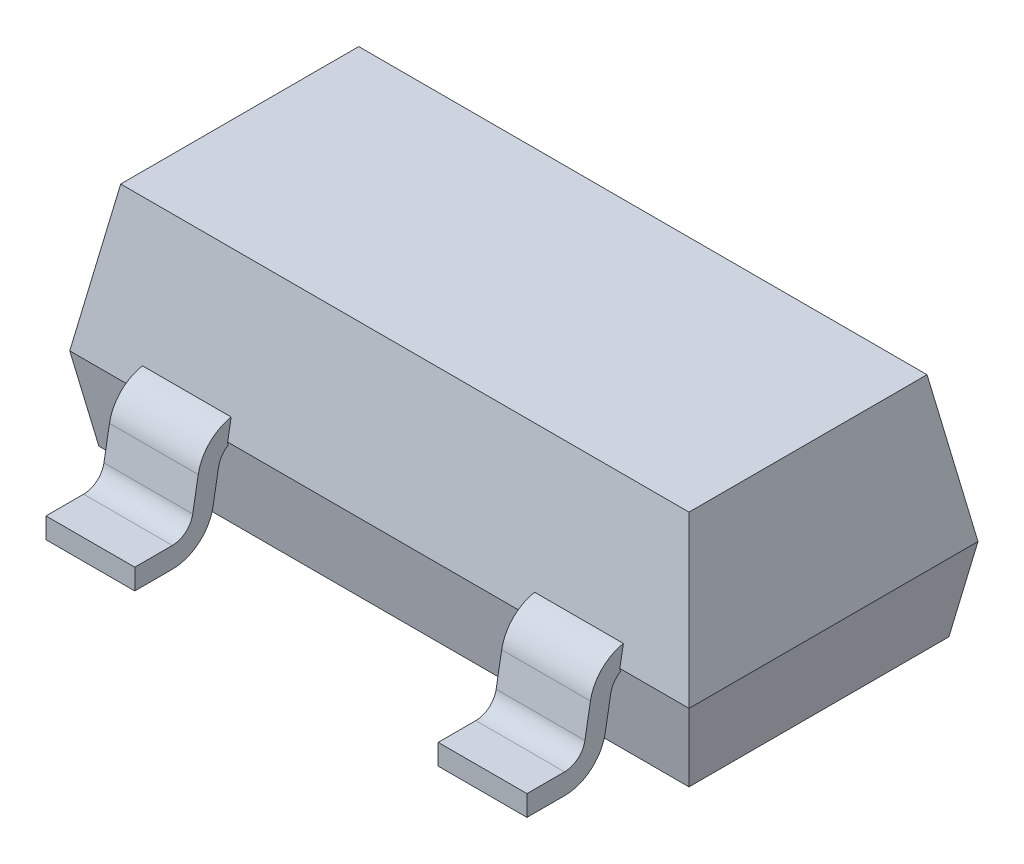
from build123d import *

# Parameters (mm, degrees)
EXTRUDE_START             = -1.165
EXTRUDE_1_DEPTH           = 2.33
SKETCH_2_W                = 0.95
SKETCH_2_H                = 1
SKETCH_2_W_2              = 1.47
CUT_EXTRUDE_1_DEPTH       = 2.711643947
SKETCH_3_W                = 3
SKETCH_3_H                = 1.4
EXTRUDE_2_DEPTH           = 0.7
EXTRUDE_2_DRAFT           = -10
EXTRUDE_2_OTHER_WAY_DEPTH = 0.4
EXTRUDE_2_OTHER_WAY_TAPER = 10


with BuildPart() as part:
    # Sketch 1 → Extrude 1 (new body)
    with BuildSketch(Plane(origin=(0, 0, 0), x_dir=(0, 0, -1), z_dir=(1, 0, 0)).offset(EXTRUDE_START)):
        with BuildLine():
            Line((-1.15, 0), (-0.967819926, 0))
            ThreePointArc((-0.967819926, 0), (-0.839262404, 0.046791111), (-0.770858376, 0.165270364))
            Line((-0.770858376, 0.165270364), (-0.74404002, 0.317364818))
            ThreePointArc((-0.74404002, 0.317364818), (-0.709838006, 0.376604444), (-0.645559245, 0.4))
            Line((-0.645559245, 0.4), (0.645559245, 0.4))
            ThreePointArc((0.645559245, 0.4), (0.709838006, 0.376604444), (0.74404002, 0.317364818))
            Line((0.74404002, 0.317364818), (0.770858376, 0.165270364))
            ThreePointArc((0.770858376, 0.165270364), (0.839262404, 0.046791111), (0.967819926, 0))
            Line((0.967819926, 0), (1.15, 0))
            Line((1.15, 0), (1.15, 0.1))
            Line((1.15, 0.1), (0.967819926, 0.1))
            ThreePointArc((0.967819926, 0.1), (0.903541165, 0.123395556), (0.869339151, 0.182635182))
            Line((0.869339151, 0.182635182), (0.842520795, 0.334729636))
            ThreePointArc((0.842520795, 0.334729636), (0.774116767, 0.453208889), (0.645559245, 0.5))
            Line((0.645559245, 0.5), (-0.645559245, 0.5))
            ThreePointArc((-0.645559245, 0.5), (-0.774116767, 0.453208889), (-0.842520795, 0.334729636))
            Line((-0.842520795, 0.334729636), (-0.869339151, 0.182635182))
            ThreePointArc((-0.869339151, 0.182635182), (-0.903541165, 0.123395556), (-0.967819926, 0.1))
            Line((-0.967819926, 0.1), (-1.15, 0.1))
            Line((-1.15, 0.1), (-1.15, 0))
        make_face()
    extrude(amount=EXTRUDE_1_DEPTH)

    # Sketch 2 → Cut-Extrude 1 (cut, through all)
    with BuildSketch(Plane(origin=(0, 0, 0), x_dir=(1, 0, 0), z_dir=(0, 1, 0))):
        with Locations((-0.69, 0.65)):
            Rectangle(SKETCH_2_W, SKETCH_2_H)
        with Locations((0, -0.65)):
            Rectangle(SKETCH_2_W_2, SKETCH_2_H)
        with Locations((0.69, 0.65)):
            Rectangle(SKETCH_2_W, SKETCH_2_H)
    extrude(amount=CUT_EXTRUDE_1_DEPTH, mode=Mode.SUBTRACT)


with BuildPart() as extrude_2_tool:
    # Sketch 3 → Extrude 2 (with draft: the straight prism first)
    with BuildSketch(Plane.XZ.offset(-0.4)):
        Rectangle(SKETCH_3_W, SKETCH_3_H)
    extrude(amount=-EXTRUDE_2_DEPTH)
    # Extrude 2: the draft: its side faces are tilted about the plane it starts from
    extrude_2_sides = [extrude_2_tool.faces().sort_by_distance(p)[0] for p in [
        (0, 0.75, -0.7),
        (1.5, 0.75, 0),
        (0, 0.75, 0.7),
        (-1.5, 0.75, 0),
    ]]
    draft(extrude_2_sides, Plane.XZ.offset(-0.4), EXTRUDE_2_DRAFT)


with BuildPart() as part_1:
    add(part.part)

    # Extrude 2: add extrude_2_tool
    add(extrude_2_tool.part)

    # Sketch 3 → Extrude 2 other way (add)
    with BuildSketch(Plane.XZ.offset(-0.4)):
        Rectangle(SKETCH_3_W, SKETCH_3_H)
    extrude(amount=EXTRUDE_2_OTHER_WAY_DEPTH, taper=EXTRUDE_2_OTHER_WAY_TAPER)


solid = part_1.part
